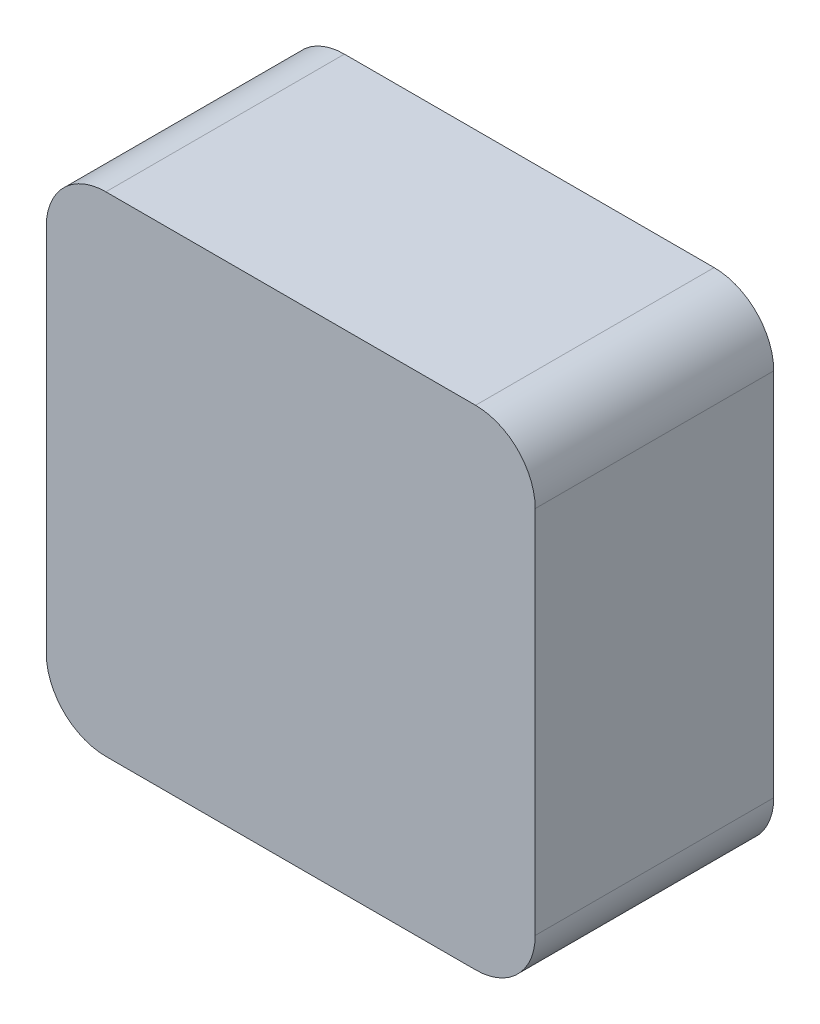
ISO-10303-21;
HEADER;
FILE_DESCRIPTION(('STEP AP214'),'2;1');
FILE_NAME('part.step','',(''),(''),'','','');
FILE_SCHEMA(('AUTOMOTIVE_DESIGN { 1 0 10303 214 1 1 1 1 }'));
ENDSEC;
DATA;
#1=APPLICATION_CONTEXT('core data for automotive mechanical design processes');
#2=APPLICATION_PROTOCOL_DEFINITION('international standard','automotive_design',2000,#1);
#3=PRODUCT_CONTEXT('',#1,'mechanical');
#4=PRODUCT('Part','Part','',(#3));
#5=PRODUCT_RELATED_PRODUCT_CATEGORY('part','',(#4));
#6=PRODUCT_DEFINITION_FORMATION('','',#4);
#7=PRODUCT_DEFINITION_CONTEXT('part definition',#1,'design');
#8=PRODUCT_DEFINITION('design','',#6,#7);
#9=PRODUCT_DEFINITION_SHAPE('','',#8);
#10=(LENGTH_UNIT() NAMED_UNIT(*) SI_UNIT(.MILLI.,.METRE.));
#11=(NAMED_UNIT(*) PLANE_ANGLE_UNIT() SI_UNIT($,.RADIAN.));
#12=(NAMED_UNIT(*) SI_UNIT($,.STERADIAN.) SOLID_ANGLE_UNIT());
#13=UNCERTAINTY_MEASURE_WITH_UNIT(LENGTH_MEASURE(1.E-05),#10,'distance_accuracy_value','');
#14=(GEOMETRIC_REPRESENTATION_CONTEXT(3) GLOBAL_UNCERTAINTY_ASSIGNED_CONTEXT((#13)) GLOBAL_UNIT_ASSIGNED_CONTEXT((#10,
#11,#12)) REPRESENTATION_CONTEXT('',''));
#15=CARTESIAN_POINT('',(0.,0.,0.));
#16=DIRECTION('',(0.,0.,1.));
#17=DIRECTION('',(1.,0.,0.));
#18=AXIS2_PLACEMENT_3D('',#15,#16,#17);
#19=CARTESIAN_POINT('',(3.10000000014,3.10000000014,4.000000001));
#20=DIRECTION('',(0.,0.,-1.));
#21=DIRECTION('',(-1.,0.,0.));
#22=AXIS2_PLACEMENT_3D('',#19,#20,#21);
#23=CYLINDRICAL_SURFACE('',#22,0.999999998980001);
#24=CARTESIAN_POINT('',(3.10000000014,3.10000000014,0.));
#25=DIRECTION('',(0.,0.,1.));
#26=DIRECTION('',(1.,0.,0.));
#27=AXIS2_PLACEMENT_3D('',#24,#25,#26);
#28=CIRCLE('',#27,0.999999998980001);
#29=CARTESIAN_POINT('',(4.09999999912,3.10000000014,0.));
#30=VERTEX_POINT('',#29);
#31=CARTESIAN_POINT('',(3.10000000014,4.09999999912,0.));
#32=VERTEX_POINT('',#31);
#33=EDGE_CURVE('E129',#30,#32,#28,.T.);
#34=ORIENTED_EDGE('',*,*,#33,.T.);
#35=DIRECTION('',(0.,0.,-1.));
#36=VECTOR('',#35,1.);
#37=CARTESIAN_POINT('',(3.10000000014,4.09999999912,4.000000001));
#38=LINE('',#37,#36);
#39=CARTESIAN_POINT('',(3.10000000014,4.09999999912,4.000000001));
#40=VERTEX_POINT('',#39);
#41=EDGE_CURVE('E11',#40,#32,#38,.T.);
#42=ORIENTED_EDGE('',*,*,#41,.F.);
#43=CARTESIAN_POINT('',(3.10000000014,3.10000000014,4.000000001));
#44=DIRECTION('',(0.,0.,1.));
#45=DIRECTION('',(1.,0.,0.));
#46=AXIS2_PLACEMENT_3D('',#43,#44,#45);
#47=CIRCLE('',#46,0.999999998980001);
#48=CARTESIAN_POINT('',(4.09999999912,3.10000000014,4.000000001));
#49=VERTEX_POINT('',#48);
#50=EDGE_CURVE('E143',#49,#40,#47,.T.);
#51=ORIENTED_EDGE('',*,*,#50,.F.);
#52=DIRECTION('',(0.,0.,-1.));
#53=VECTOR('',#52,1.);
#54=CARTESIAN_POINT('',(4.09999999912,3.10000000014,4.000000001));
#55=LINE('',#54,#53);
#56=EDGE_CURVE('E125',#49,#30,#55,.T.);
#57=ORIENTED_EDGE('',*,*,#56,.T.);
#58=EDGE_LOOP('',(#34,#42,#51,#57));
#59=FACE_BOUND('',#58,.T.);
#60=ADVANCED_FACE('F33',(#59),#23,.T.);
#61=CARTESIAN_POINT('',(3.10000000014,4.09999999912,4.000000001));
#62=DIRECTION('',(0.,-1.,0.));
#63=DIRECTION('',(0.,0.,-1.));
#64=AXIS2_PLACEMENT_3D('',#61,#62,#63);
#65=PLANE('',#64);
#66=DIRECTION('',(-1.,0.,0.));
#67=VECTOR('',#66,1.);
#68=CARTESIAN_POINT('',(3.10000000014,4.09999999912,0.));
#69=LINE('',#68,#67);
#70=CARTESIAN_POINT('',(-3.10000000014,4.09999999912,0.));
#71=VERTEX_POINT('',#70);
#72=EDGE_CURVE('E132',#32,#71,#69,.T.);
#73=ORIENTED_EDGE('',*,*,#72,.T.);
#74=DIRECTION('',(0.,0.,-1.));
#75=VECTOR('',#74,1.);
#76=CARTESIAN_POINT('',(-3.10000000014,4.09999999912,4.000000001));
#77=LINE('',#76,#75);
#78=CARTESIAN_POINT('',(-3.10000000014,4.09999999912,4.000000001));
#79=VERTEX_POINT('',#78);
#80=EDGE_CURVE('E41',#79,#71,#77,.T.);
#81=ORIENTED_EDGE('',*,*,#80,.F.);
#82=DIRECTION('',(-1.,0.,0.));
#83=VECTOR('',#82,1.);
#84=CARTESIAN_POINT('',(3.10000000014,4.09999999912,4.000000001));
#85=LINE('',#84,#83);
#86=EDGE_CURVE('E92',#40,#79,#85,.T.);
#87=ORIENTED_EDGE('',*,*,#86,.F.);
#88=ORIENTED_EDGE('',*,*,#41,.T.);
#89=EDGE_LOOP('',(#73,#81,#87,#88));
#90=FACE_BOUND('',#89,.T.);
#91=ADVANCED_FACE('F178',(#90),#65,.F.);
#92=CARTESIAN_POINT('',(-3.10000000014,3.10000000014,4.000000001));
#93=DIRECTION('',(0.,0.,-1.));
#94=DIRECTION('',(-1.,0.,0.));
#95=AXIS2_PLACEMENT_3D('',#92,#93,#94);
#96=CYLINDRICAL_SURFACE('',#95,0.999999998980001);
#97=CARTESIAN_POINT('',(-3.10000000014,3.10000000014,0.));
#98=DIRECTION('',(0.,0.,1.));
#99=DIRECTION('',(1.,0.,0.));
#100=AXIS2_PLACEMENT_3D('',#97,#98,#99);
#101=CIRCLE('',#100,0.999999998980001);
#102=CARTESIAN_POINT('',(-4.09999999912,3.10000000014,0.));
#103=VERTEX_POINT('',#102);
#104=EDGE_CURVE('E134',#71,#103,#101,.T.);
#105=ORIENTED_EDGE('',*,*,#104,.T.);
#106=DIRECTION('',(0.,0.,-1.));
#107=VECTOR('',#106,1.);
#108=CARTESIAN_POINT('',(-4.09999999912,3.10000000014,4.000000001));
#109=LINE('',#108,#107);
#110=CARTESIAN_POINT('',(-4.09999999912,3.10000000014,4.000000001));
#111=VERTEX_POINT('',#110);
#112=EDGE_CURVE('E150',#111,#103,#109,.T.);
#113=ORIENTED_EDGE('',*,*,#112,.F.);
#114=CARTESIAN_POINT('',(-3.10000000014,3.10000000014,4.000000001));
#115=DIRECTION('',(0.,0.,1.));
#116=DIRECTION('',(1.,0.,0.));
#117=AXIS2_PLACEMENT_3D('',#114,#115,#116);
#118=CIRCLE('',#117,0.999999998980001);
#119=EDGE_CURVE('E158',#79,#111,#118,.T.);
#120=ORIENTED_EDGE('',*,*,#119,.F.);
#121=ORIENTED_EDGE('',*,*,#80,.T.);
#122=EDGE_LOOP('',(#105,#113,#120,#121));
#123=FACE_BOUND('',#122,.T.);
#124=ADVANCED_FACE('F156',(#123),#96,.T.);
#125=CARTESIAN_POINT('',(-4.09999999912,3.10000000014,4.000000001));
#126=DIRECTION('',(1.,0.,0.));
#127=DIRECTION('',(0.,0.,-1.));
#128=AXIS2_PLACEMENT_3D('',#125,#126,#127);
#129=PLANE('',#128);
#130=DIRECTION('',(0.,-1.,0.));
#131=VECTOR('',#130,1.);
#132=CARTESIAN_POINT('',(-4.09999999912,3.10000000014,0.));
#133=LINE('',#132,#131);
#134=CARTESIAN_POINT('',(-4.09999999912,-3.10000000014,0.));
#135=VERTEX_POINT('',#134);
#136=EDGE_CURVE('E136',#103,#135,#133,.T.);
#137=ORIENTED_EDGE('',*,*,#136,.T.);
#138=DIRECTION('',(0.,0.,-1.));
#139=VECTOR('',#138,1.);
#140=CARTESIAN_POINT('',(-4.09999999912,-3.10000000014,4.000000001));
#141=LINE('',#140,#139);
#142=CARTESIAN_POINT('',(-4.09999999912,-3.10000000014,4.000000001));
#143=VERTEX_POINT('',#142);
#144=EDGE_CURVE('E147',#143,#135,#141,.T.);
#145=ORIENTED_EDGE('',*,*,#144,.F.);
#146=DIRECTION('',(0.,-1.,0.));
#147=VECTOR('',#146,1.);
#148=CARTESIAN_POINT('',(-4.09999999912,3.10000000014,4.000000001));
#149=LINE('',#148,#147);
#150=EDGE_CURVE('E170',#111,#143,#149,.T.);
#151=ORIENTED_EDGE('',*,*,#150,.F.);
#152=ORIENTED_EDGE('',*,*,#112,.T.);
#153=EDGE_LOOP('',(#137,#145,#151,#152));
#154=FACE_BOUND('',#153,.T.);
#155=ADVANCED_FACE('F166',(#154),#129,.F.);
#156=CARTESIAN_POINT('',(-3.10000000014,-3.10000000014,4.000000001));
#157=DIRECTION('',(0.,0.,-1.));
#158=DIRECTION('',(-1.,0.,0.));
#159=AXIS2_PLACEMENT_3D('',#156,#157,#158);
#160=CYLINDRICAL_SURFACE('',#159,0.999999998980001);
#161=CARTESIAN_POINT('',(-3.10000000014,-3.10000000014,0.));
#162=DIRECTION('',(0.,0.,1.));
#163=DIRECTION('',(1.,0.,0.));
#164=AXIS2_PLACEMENT_3D('',#161,#162,#163);
#165=CIRCLE('',#164,0.999999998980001);
#166=CARTESIAN_POINT('',(-3.10000000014,-4.09999999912,0.));
#167=VERTEX_POINT('',#166);
#168=EDGE_CURVE('E138',#135,#167,#165,.T.);
#169=ORIENTED_EDGE('',*,*,#168,.T.);
#170=DIRECTION('',(0.,0.,-1.));
#171=VECTOR('',#170,1.);
#172=CARTESIAN_POINT('',(-3.10000000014,-4.09999999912,4.000000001));
#173=LINE('',#172,#171);
#174=CARTESIAN_POINT('',(-3.10000000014,-4.09999999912,4.000000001));
#175=VERTEX_POINT('',#174);
#176=EDGE_CURVE('E120',#175,#167,#173,.T.);
#177=ORIENTED_EDGE('',*,*,#176,.F.);
#178=CARTESIAN_POINT('',(-3.10000000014,-3.10000000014,4.000000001));
#179=DIRECTION('',(0.,0.,1.));
#180=DIRECTION('',(1.,0.,0.));
#181=AXIS2_PLACEMENT_3D('',#178,#179,#180);
#182=CIRCLE('',#181,0.999999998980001);
#183=EDGE_CURVE('E111',#143,#175,#182,.T.);
#184=ORIENTED_EDGE('',*,*,#183,.F.);
#185=ORIENTED_EDGE('',*,*,#144,.T.);
#186=EDGE_LOOP('',(#169,#177,#184,#185));
#187=FACE_BOUND('',#186,.T.);
#188=ADVANCED_FACE('F169',(#187),#160,.T.);
#189=CARTESIAN_POINT('',(-3.10000000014,-4.09999999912,4.000000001));
#190=DIRECTION('',(0.,1.,0.));
#191=DIRECTION('',(0.,0.,1.));
#192=AXIS2_PLACEMENT_3D('',#189,#190,#191);
#193=PLANE('',#192);
#194=DIRECTION('',(1.,0.,0.));
#195=VECTOR('',#194,1.);
#196=CARTESIAN_POINT('',(-3.10000000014,-4.09999999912,0.));
#197=LINE('',#196,#195);
#198=CARTESIAN_POINT('',(3.10000000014,-4.09999999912,0.));
#199=VERTEX_POINT('',#198);
#200=EDGE_CURVE('E119',#167,#199,#197,.T.);
#201=ORIENTED_EDGE('',*,*,#200,.T.);
#202=DIRECTION('',(0.,0.,-1.));
#203=VECTOR('',#202,1.);
#204=CARTESIAN_POINT('',(3.10000000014,-4.09999999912,4.000000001));
#205=LINE('',#204,#203);
#206=CARTESIAN_POINT('',(3.10000000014,-4.09999999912,4.000000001));
#207=VERTEX_POINT('',#206);
#208=EDGE_CURVE('E116',#207,#199,#205,.T.);
#209=ORIENTED_EDGE('',*,*,#208,.F.);
#210=DIRECTION('',(1.,0.,0.));
#211=VECTOR('',#210,1.);
#212=CARTESIAN_POINT('',(-3.10000000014,-4.09999999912,4.000000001));
#213=LINE('',#212,#211);
#214=EDGE_CURVE('E105',#175,#207,#213,.T.);
#215=ORIENTED_EDGE('',*,*,#214,.F.);
#216=ORIENTED_EDGE('',*,*,#176,.T.);
#217=EDGE_LOOP('',(#201,#209,#215,#216));
#218=FACE_BOUND('',#217,.T.);
#219=ADVANCED_FACE('F117',(#218),#193,.F.);
#220=CARTESIAN_POINT('',(3.10000000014,-3.10000000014,4.000000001));
#221=DIRECTION('',(0.,0.,-1.));
#222=DIRECTION('',(-1.,0.,0.));
#223=AXIS2_PLACEMENT_3D('',#220,#221,#222);
#224=CYLINDRICAL_SURFACE('',#223,0.999999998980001);
#225=CARTESIAN_POINT('',(3.10000000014,-3.10000000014,0.));
#226=DIRECTION('',(0.,0.,1.));
#227=DIRECTION('',(1.,0.,0.));
#228=AXIS2_PLACEMENT_3D('',#225,#226,#227);
#229=CIRCLE('',#228,0.999999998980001);
#230=CARTESIAN_POINT('',(4.09999999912,-3.10000000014,0.));
#231=VERTEX_POINT('',#230);
#232=EDGE_CURVE('E78',#199,#231,#229,.T.);
#233=ORIENTED_EDGE('',*,*,#232,.T.);
#234=DIRECTION('',(0.,0.,-1.));
#235=VECTOR('',#234,1.);
#236=CARTESIAN_POINT('',(4.09999999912,-3.10000000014,4.000000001));
#237=LINE('',#236,#235);
#238=CARTESIAN_POINT('',(4.09999999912,-3.10000000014,4.000000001));
#239=VERTEX_POINT('',#238);
#240=EDGE_CURVE('E121',#239,#231,#237,.T.);
#241=ORIENTED_EDGE('',*,*,#240,.F.);
#242=CARTESIAN_POINT('',(3.10000000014,-3.10000000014,4.000000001));
#243=DIRECTION('',(0.,0.,1.));
#244=DIRECTION('',(1.,0.,0.));
#245=AXIS2_PLACEMENT_3D('',#242,#243,#244);
#246=CIRCLE('',#245,0.999999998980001);
#247=EDGE_CURVE('E109',#207,#239,#246,.T.);
#248=ORIENTED_EDGE('',*,*,#247,.F.);
#249=ORIENTED_EDGE('',*,*,#208,.T.);
#250=EDGE_LOOP('',(#233,#241,#248,#249));
#251=FACE_BOUND('',#250,.T.);
#252=ADVANCED_FACE('F123',(#251),#224,.T.);
#253=CARTESIAN_POINT('',(4.09999999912,-3.10000000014,4.000000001));
#254=DIRECTION('',(-1.,0.,0.));
#255=DIRECTION('',(0.,0.,1.));
#256=AXIS2_PLACEMENT_3D('',#253,#254,#255);
#257=PLANE('',#256);
#258=DIRECTION('',(0.,1.,0.));
#259=VECTOR('',#258,1.);
#260=CARTESIAN_POINT('',(4.09999999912,-3.10000000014,0.));
#261=LINE('',#260,#259);
#262=EDGE_CURVE('E84',#231,#30,#261,.T.);
#263=ORIENTED_EDGE('',*,*,#262,.T.);
#264=ORIENTED_EDGE('',*,*,#56,.F.);
#265=DIRECTION('',(0.,1.,0.));
#266=VECTOR('',#265,1.);
#267=CARTESIAN_POINT('',(4.09999999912,-3.10000000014,4.000000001));
#268=LINE('',#267,#266);
#269=EDGE_CURVE('E49',#239,#49,#268,.T.);
#270=ORIENTED_EDGE('',*,*,#269,.F.);
#271=ORIENTED_EDGE('',*,*,#240,.T.);
#272=EDGE_LOOP('',(#263,#264,#270,#271));
#273=FACE_BOUND('',#272,.T.);
#274=ADVANCED_FACE('F194',(#273),#257,.F.);
#275=CARTESIAN_POINT('',(3.10000000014,3.10000000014,4.000000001));
#276=DIRECTION('',(0.,0.,1.));
#277=DIRECTION('',(1.,0.,0.));
#278=AXIS2_PLACEMENT_3D('',#275,#276,#277);
#279=PLANE('',#278);
#280=ORIENTED_EDGE('',*,*,#50,.T.);
#281=ORIENTED_EDGE('',*,*,#86,.T.);
#282=ORIENTED_EDGE('',*,*,#119,.T.);
#283=ORIENTED_EDGE('',*,*,#150,.T.);
#284=ORIENTED_EDGE('',*,*,#183,.T.);
#285=ORIENTED_EDGE('',*,*,#214,.T.);
#286=ORIENTED_EDGE('',*,*,#247,.T.);
#287=ORIENTED_EDGE('',*,*,#269,.T.);
#288=EDGE_LOOP('',(#280,#281,#282,#283,#284,#285,#286,#287));
#289=FACE_BOUND('',#288,.T.);
#290=ADVANCED_FACE('F107',(#289),#279,.T.);
#291=CARTESIAN_POINT('',(3.10000000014,3.10000000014,0.));
#292=DIRECTION('',(0.,0.,1.));
#293=DIRECTION('',(1.,0.,0.));
#294=AXIS2_PLACEMENT_3D('',#291,#292,#293);
#295=PLANE('',#294);
#296=ORIENTED_EDGE('',*,*,#33,.F.);
#297=ORIENTED_EDGE('',*,*,#262,.F.);
#298=ORIENTED_EDGE('',*,*,#232,.F.);
#299=ORIENTED_EDGE('',*,*,#200,.F.);
#300=ORIENTED_EDGE('',*,*,#168,.F.);
#301=ORIENTED_EDGE('',*,*,#136,.F.);
#302=ORIENTED_EDGE('',*,*,#104,.F.);
#303=ORIENTED_EDGE('',*,*,#72,.F.);
#304=EDGE_LOOP('',(#296,#297,#298,#299,#300,#301,#302,#303));
#305=FACE_BOUND('',#304,.T.);
#306=ADVANCED_FACE('F162',(#305),#295,.F.);
#307=CLOSED_SHELL('',(#60,#91,#124,#155,#188,#219,#252,#274,#290,#306));
#308=MANIFOLD_SOLID_BREP('B2',#307);
#309=ADVANCED_BREP_SHAPE_REPRESENTATION('',(#18,#308),#14);
#310=SHAPE_DEFINITION_REPRESENTATION(#9,#309);
ENDSEC;
END-ISO-10303-21;
